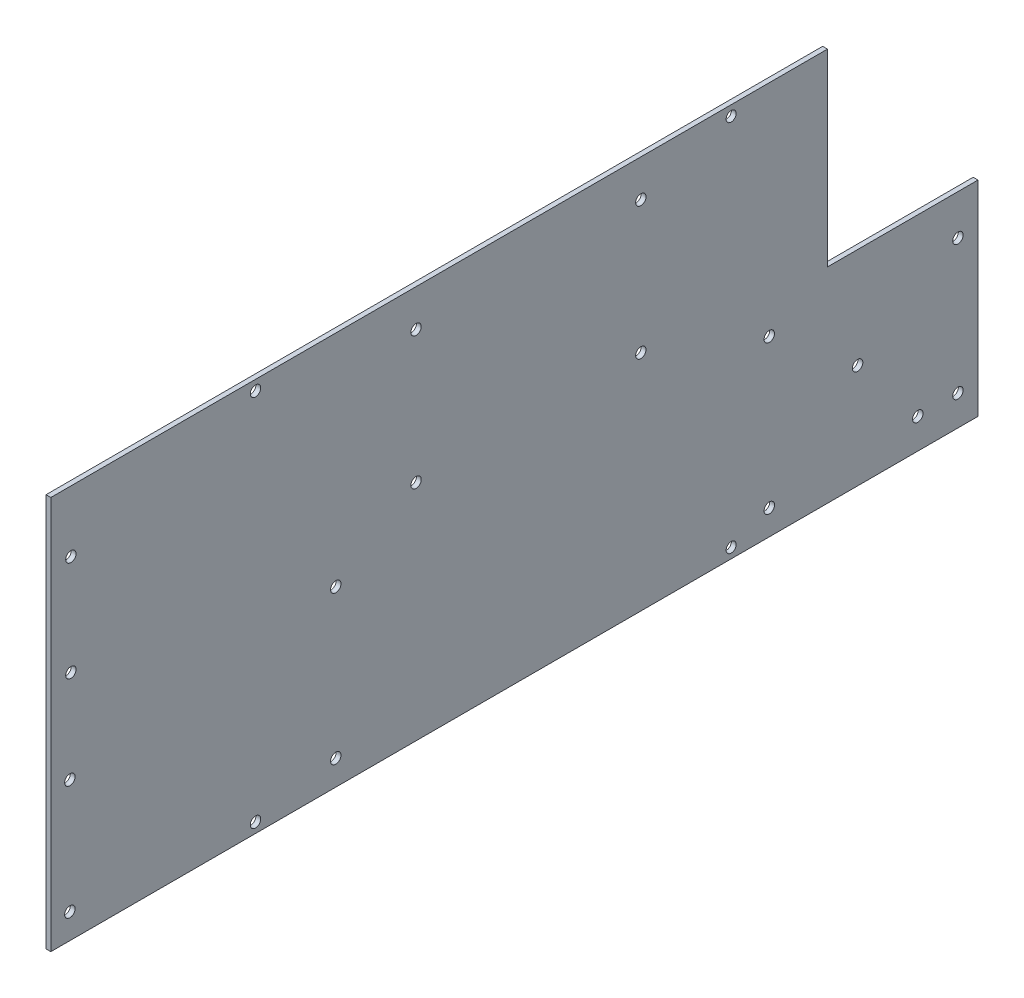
ISO-10303-21;
HEADER;
FILE_DESCRIPTION(('STEP AP214'),'2;1');
FILE_NAME('part.step','',(''),(''),'','','');
FILE_SCHEMA(('AUTOMOTIVE_DESIGN { 1 0 10303 214 1 1 1 1 }'));
ENDSEC;
DATA;
#1=APPLICATION_CONTEXT('core data for automotive mechanical design processes');
#2=APPLICATION_PROTOCOL_DEFINITION('international standard','automotive_design',2000,#1);
#3=PRODUCT_CONTEXT('',#1,'mechanical');
#4=PRODUCT('Part','Part','',(#3));
#5=PRODUCT_RELATED_PRODUCT_CATEGORY('part','',(#4));
#6=PRODUCT_DEFINITION_FORMATION('','',#4);
#7=PRODUCT_DEFINITION_CONTEXT('part definition',#1,'design');
#8=PRODUCT_DEFINITION('design','',#6,#7);
#9=PRODUCT_DEFINITION_SHAPE('','',#8);
#10=(LENGTH_UNIT() NAMED_UNIT(*) SI_UNIT(.MILLI.,.METRE.));
#11=(NAMED_UNIT(*) PLANE_ANGLE_UNIT() SI_UNIT($,.RADIAN.));
#12=(NAMED_UNIT(*) SI_UNIT($,.STERADIAN.) SOLID_ANGLE_UNIT());
#13=UNCERTAINTY_MEASURE_WITH_UNIT(LENGTH_MEASURE(1.E-05),#10,'distance_accuracy_value','');
#14=(GEOMETRIC_REPRESENTATION_CONTEXT(3) GLOBAL_UNCERTAINTY_ASSIGNED_CONTEXT((#13)) GLOBAL_UNIT_ASSIGNED_CONTEXT((#10,
#11,#12)) REPRESENTATION_CONTEXT('',''));
#15=CARTESIAN_POINT('',(0.,0.,0.));
#16=DIRECTION('',(0.,0.,1.));
#17=DIRECTION('',(1.,0.,0.));
#18=AXIS2_PLACEMENT_3D('',#15,#16,#17);
#19=CARTESIAN_POINT('',(1.52400000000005,64.7700000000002,-228.599999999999));
#20=DIRECTION('',(-1.00000000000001,0.,0.));
#21=DIRECTION('',(0.,0.,1.));
#22=AXIS2_PLACEMENT_3D('',#19,#20,#21);
#23=PLANE('',#22);
#24=CARTESIAN_POINT('',(1.524,9.55547999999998,-209.55));
#25=DIRECTION('',(1.00000000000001,0.,0.));
#26=DIRECTION('',(0.,0.,-1.));
#27=AXIS2_PLACEMENT_3D('',#24,#25,#26);
#28=CIRCLE('',#27,1.65100000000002);
#29=CARTESIAN_POINT('',(1.524,9.55547999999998,-211.201));
#30=VERTEX_POINT('',#29);
#31=EDGE_CURVE('E244',#30,#30,#28,.T.);
#32=ORIENTED_EDGE('',*,*,#31,.F.);
#33=EDGE_LOOP('',(#32));
#34=FACE_BOUND('',#33,.T.);
#35=CARTESIAN_POINT('',(1.52400000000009,9.55548000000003,-222.25));
#36=DIRECTION('',(1.00000000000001,0.,0.));
#37=DIRECTION('',(0.,0.,-1.));
#38=AXIS2_PLACEMENT_3D('',#35,#36,#37);
#39=CIRCLE('',#38,1.65099999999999);
#40=CARTESIAN_POINT('',(1.52400000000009,9.55548000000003,-223.901));
#41=VERTEX_POINT('',#40);
#42=EDGE_CURVE('E246',#41,#41,#39,.T.);
#43=ORIENTED_EDGE('',*,*,#42,.F.);
#44=EDGE_LOOP('',(#43));
#45=FACE_BOUND('',#44,.T.);
#46=CARTESIAN_POINT('',(1.52399999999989,121.285000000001,-150.495));
#47=DIRECTION('',(1.00000000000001,0.,0.));
#48=DIRECTION('',(0.,0.,-1.));
#49=AXIS2_PLACEMENT_3D('',#46,#47,#48);
#50=CIRCLE('',#49,1.58749999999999);
#51=CARTESIAN_POINT('',(1.52399999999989,121.285000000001,-152.0825));
#52=VERTEX_POINT('',#51);
#53=EDGE_CURVE('E261',#52,#52,#50,.T.);
#54=ORIENTED_EDGE('',*,*,#53,.F.);
#55=EDGE_LOOP('',(#54));
#56=FACE_BOUND('',#55,.T.);
#57=CARTESIAN_POINT('',(1.52400000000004,33.0200000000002,-190.5));
#58=DIRECTION('',(1.00000000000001,0.,0.));
#59=DIRECTION('',(0.,0.,-1.));
#60=AXIS2_PLACEMENT_3D('',#57,#58,#59);
#61=CIRCLE('',#60,1.65100000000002);
#62=CARTESIAN_POINT('',(1.52400000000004,33.0200000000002,-192.151));
#63=VERTEX_POINT('',#62);
#64=EDGE_CURVE('E273',#63,#63,#61,.T.);
#65=ORIENTED_EDGE('',*,*,#64,.F.);
#66=EDGE_LOOP('',(#65));
#67=FACE_BOUND('',#66,.T.);
#68=CARTESIAN_POINT('',(1.52400000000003,121.285000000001,0.));
#69=DIRECTION('',(1.00000000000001,0.,0.));
#70=DIRECTION('',(0.,0.,-1.));
#71=AXIS2_PLACEMENT_3D('',#68,#69,#70);
#72=CIRCLE('',#71,1.651);
#73=CARTESIAN_POINT('',(1.52400000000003,121.285000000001,-1.65099999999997));
#74=VERTEX_POINT('',#73);
#75=EDGE_CURVE('E285',#74,#74,#72,.T.);
#76=ORIENTED_EDGE('',*,*,#75,.F.);
#77=EDGE_LOOP('',(#76));
#78=FACE_BOUND('',#77,.T.);
#79=CARTESIAN_POINT('',(1.52399999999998,7.93750000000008,58.7375000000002));
#80=DIRECTION('',(1.00000000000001,0.,0.));
#81=DIRECTION('',(0.,0.,-1.));
#82=AXIS2_PLACEMENT_3D('',#79,#80,#81);
#83=CIRCLE('',#82,1.65100000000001);
#84=CARTESIAN_POINT('',(1.52399999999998,7.93750000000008,57.0865000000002));
#85=VERTEX_POINT('',#84);
#86=EDGE_CURVE('E297',#85,#85,#83,.T.);
#87=ORIENTED_EDGE('',*,*,#86,.F.);
#88=EDGE_LOOP('',(#87));
#89=FACE_BOUND('',#88,.T.);
#90=CARTESIAN_POINT('',(1.52400000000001,7.93750000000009,-25.3999999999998));
#91=DIRECTION('',(1.00000000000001,0.,0.));
#92=DIRECTION('',(0.,0.,-1.));
#93=AXIS2_PLACEMENT_3D('',#90,#91,#92);
#94=CIRCLE('',#93,1.651);
#95=CARTESIAN_POINT('',(1.52400000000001,7.93750000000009,-27.0509999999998));
#96=VERTEX_POINT('',#95);
#97=EDGE_CURVE('E309',#96,#96,#94,.T.);
#98=ORIENTED_EDGE('',*,*,#97,.F.);
#99=EDGE_LOOP('',(#98));
#100=FACE_BOUND('',#99,.T.);
#101=CARTESIAN_POINT('',(1.52400000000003,54.9275000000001,-162.559999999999));
#102=DIRECTION('',(1.00000000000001,0.,0.));
#103=DIRECTION('',(0.,0.,-1.));
#104=AXIS2_PLACEMENT_3D('',#101,#102,#103);
#105=CIRCLE('',#104,1.65100000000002);
#106=CARTESIAN_POINT('',(1.52400000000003,54.9275000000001,-164.210999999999));
#107=VERTEX_POINT('',#106);
#108=EDGE_CURVE('E321',#107,#107,#105,.T.);
#109=ORIENTED_EDGE('',*,*,#108,.F.);
#110=EDGE_LOOP('',(#109));
#111=FACE_BOUND('',#110,.T.);
#112=CARTESIAN_POINT('',(1.52399999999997,73.3425000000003,58.42));
#113=DIRECTION('',(1.00000000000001,0.,0.));
#114=DIRECTION('',(0.,0.,-1.));
#115=AXIS2_PLACEMENT_3D('',#112,#113,#114);
#116=CIRCLE('',#115,1.63830000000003);
#117=CARTESIAN_POINT('',(1.52399999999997,73.3425000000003,56.7816999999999));
#118=VERTEX_POINT('',#117);
#119=EDGE_CURVE('E333',#118,#118,#116,.T.);
#120=ORIENTED_EDGE('',*,*,#119,.F.);
#121=EDGE_LOOP('',(#120));
#122=FACE_BOUND('',#121,.T.);
#123=CARTESIAN_POINT('',(1.524,112.7125,-121.92));
#124=DIRECTION('',(1.00000000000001,0.,0.));
#125=DIRECTION('',(0.,0.,-1.));
#126=AXIS2_PLACEMENT_3D('',#123,#124,#125);
#127=CIRCLE('',#126,1.63829999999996);
#128=CARTESIAN_POINT('',(1.524,112.7125,-123.5583));
#129=VERTEX_POINT('',#128);
#130=EDGE_CURVE('E345',#129,#129,#127,.T.);
#131=ORIENTED_EDGE('',*,*,#130,.F.);
#132=EDGE_LOOP('',(#131));
#133=FACE_BOUND('',#132,.T.);
#134=CARTESIAN_POINT('',(1.524,112.7125,-50.7999999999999));
#135=DIRECTION('',(1.00000000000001,0.,0.));
#136=DIRECTION('',(0.,0.,-1.));
#137=AXIS2_PLACEMENT_3D('',#134,#135,#136);
#138=CIRCLE('',#137,1.63830000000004);
#139=CARTESIAN_POINT('',(1.524,112.7125,-52.4382999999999));
#140=VERTEX_POINT('',#139);
#141=EDGE_CURVE('E119',#140,#140,#138,.T.);
#142=ORIENTED_EDGE('',*,*,#141,.F.);
#143=EDGE_LOOP('',(#142));
#144=FACE_BOUND('',#143,.T.);
#145=DIRECTION('',(0.,1.00000000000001,0.));
#146=VECTOR('',#145,1.);
#147=CARTESIAN_POINT('',(1.52400000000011,0.,-228.6));
#148=LINE('',#147,#146);
#149=CARTESIAN_POINT('',(1.52400000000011,0.,-228.6));
#150=VERTEX_POINT('',#149);
#151=CARTESIAN_POINT('',(1.52400000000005,64.7700000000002,-228.599999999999));
#152=VERTEX_POINT('',#151);
#153=EDGE_CURVE('E126',#150,#152,#148,.T.);
#154=ORIENTED_EDGE('',*,*,#153,.T.);
#155=DIRECTION('',(0.,0.,1.));
#156=VECTOR('',#155,1.);
#157=CARTESIAN_POINT('',(1.52400000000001,64.7700000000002,-180.974999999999));
#158=LINE('',#157,#156);
#159=CARTESIAN_POINT('',(1.52400000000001,64.7700000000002,-180.974999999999));
#160=VERTEX_POINT('',#159);
#161=EDGE_CURVE('E84',#152,#160,#158,.T.);
#162=ORIENTED_EDGE('',*,*,#161,.T.);
#163=DIRECTION('',(0.,1.00000000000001,0.));
#164=VECTOR('',#163,1.);
#165=CARTESIAN_POINT('',(1.52400000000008,124.46,-180.975));
#166=LINE('',#165,#164);
#167=CARTESIAN_POINT('',(1.52400000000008,124.46,-180.975));
#168=VERTEX_POINT('',#167);
#169=EDGE_CURVE('E97',#160,#168,#166,.T.);
#170=ORIENTED_EDGE('',*,*,#169,.T.);
#171=DIRECTION('',(0.,0.,1.));
#172=VECTOR('',#171,1.);
#173=CARTESIAN_POINT('',(1.52400000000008,124.46,-180.975));
#174=LINE('',#173,#172);
#175=CARTESIAN_POINT('',(1.52400000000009,124.460000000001,64.77));
#176=VERTEX_POINT('',#175);
#177=EDGE_CURVE('E91',#168,#176,#174,.T.);
#178=ORIENTED_EDGE('',*,*,#177,.T.);
#179=DIRECTION('',(0.,-1.00000000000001,0.));
#180=VECTOR('',#179,1.);
#181=CARTESIAN_POINT('',(1.52400000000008,0.,64.7700000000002));
#182=LINE('',#181,#180);
#183=CARTESIAN_POINT('',(1.52400000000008,0.,64.7700000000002));
#184=VERTEX_POINT('',#183);
#185=EDGE_CURVE('E95',#176,#184,#182,.T.);
#186=ORIENTED_EDGE('',*,*,#185,.T.);
#187=DIRECTION('',(0.,0.,-1.));
#188=VECTOR('',#187,1.);
#189=CARTESIAN_POINT('',(1.52400000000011,0.,-228.6));
#190=LINE('',#189,#188);
#191=EDGE_CURVE('E47',#184,#150,#190,.T.);
#192=ORIENTED_EDGE('',*,*,#191,.T.);
#193=EDGE_LOOP('',(#154,#162,#170,#178,#186,#192));
#194=FACE_BOUND('',#193,.T.);
#195=CARTESIAN_POINT('',(1.524,70.8025000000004,-50.8));
#196=DIRECTION('',(1.00000000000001,0.,0.));
#197=DIRECTION('',(0.,0.,-1.));
#198=AXIS2_PLACEMENT_3D('',#195,#196,#197);
#199=CIRCLE('',#198,1.63830000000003);
#200=CARTESIAN_POINT('',(1.524,70.8025000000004,-52.4383));
#201=VERTEX_POINT('',#200);
#202=EDGE_CURVE('E351',#201,#201,#199,.T.);
#203=ORIENTED_EDGE('',*,*,#202,.F.);
#204=EDGE_LOOP('',(#203));
#205=FACE_BOUND('',#204,.T.);
#206=CARTESIAN_POINT('',(1.52399999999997,70.8025000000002,-121.92));
#207=DIRECTION('',(1.00000000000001,0.,0.));
#208=DIRECTION('',(0.,0.,-1.));
#209=AXIS2_PLACEMENT_3D('',#206,#207,#208);
#210=CIRCLE('',#209,1.63829999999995);
#211=CARTESIAN_POINT('',(1.52399999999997,70.8025000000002,-123.5583));
#212=VERTEX_POINT('',#211);
#213=EDGE_CURVE('E339',#212,#212,#210,.T.);
#214=ORIENTED_EDGE('',*,*,#213,.F.);
#215=EDGE_LOOP('',(#214));
#216=FACE_BOUND('',#215,.T.);
#217=CARTESIAN_POINT('',(1.52400000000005,105.092500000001,58.42));
#218=DIRECTION('',(1.00000000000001,0.,0.));
#219=DIRECTION('',(0.,0.,-1.));
#220=AXIS2_PLACEMENT_3D('',#217,#218,#219);
#221=CIRCLE('',#220,1.6383);
#222=CARTESIAN_POINT('',(1.52400000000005,105.092500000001,56.7817));
#223=VERTEX_POINT('',#222);
#224=EDGE_CURVE('E327',#223,#223,#221,.T.);
#225=ORIENTED_EDGE('',*,*,#224,.F.);
#226=EDGE_LOOP('',(#225));
#227=FACE_BOUND('',#226,.T.);
#228=CARTESIAN_POINT('',(1.52400000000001,54.9275,-25.4));
#229=DIRECTION('',(1.00000000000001,0.,0.));
#230=DIRECTION('',(0.,0.,-1.));
#231=AXIS2_PLACEMENT_3D('',#228,#229,#230);
#232=CIRCLE('',#231,1.651);
#233=CARTESIAN_POINT('',(1.52400000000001,54.9275,-27.051));
#234=VERTEX_POINT('',#233);
#235=EDGE_CURVE('E315',#234,#234,#232,.T.);
#236=ORIENTED_EDGE('',*,*,#235,.F.);
#237=EDGE_LOOP('',(#236));
#238=FACE_BOUND('',#237,.T.);
#239=CARTESIAN_POINT('',(1.52399999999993,7.93750000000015,-162.56));
#240=DIRECTION('',(1.00000000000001,0.,0.));
#241=DIRECTION('',(0.,0.,-1.));
#242=AXIS2_PLACEMENT_3D('',#239,#240,#241);
#243=CIRCLE('',#242,1.65100000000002);
#244=CARTESIAN_POINT('',(1.52399999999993,7.93750000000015,-164.211));
#245=VERTEX_POINT('',#244);
#246=EDGE_CURVE('E303',#245,#245,#243,.T.);
#247=ORIENTED_EDGE('',*,*,#246,.F.);
#248=EDGE_LOOP('',(#247));
#249=FACE_BOUND('',#248,.T.);
#250=CARTESIAN_POINT('',(1.52400000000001,44.1147200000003,58.7375000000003));
#251=DIRECTION('',(1.00000000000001,0.,0.));
#252=DIRECTION('',(0.,0.,-1.));
#253=AXIS2_PLACEMENT_3D('',#250,#251,#252);
#254=CIRCLE('',#253,1.65100000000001);
#255=CARTESIAN_POINT('',(1.52400000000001,44.1147200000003,57.0865000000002));
#256=VERTEX_POINT('',#255);
#257=EDGE_CURVE('E291',#256,#256,#254,.T.);
#258=ORIENTED_EDGE('',*,*,#257,.F.);
#259=EDGE_LOOP('',(#258));
#260=FACE_BOUND('',#259,.T.);
#261=CARTESIAN_POINT('',(1.52399999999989,3.17499999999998,0.));
#262=DIRECTION('',(1.00000000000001,0.,0.));
#263=DIRECTION('',(0.,0.,-1.));
#264=AXIS2_PLACEMENT_3D('',#261,#262,#263);
#265=CIRCLE('',#264,1.651);
#266=CARTESIAN_POINT('',(1.52399999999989,3.17499999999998,-1.65099999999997));
#267=VERTEX_POINT('',#266);
#268=EDGE_CURVE('E279',#267,#267,#265,.T.);
#269=ORIENTED_EDGE('',*,*,#268,.F.);
#270=EDGE_LOOP('',(#269));
#271=FACE_BOUND('',#270,.T.);
#272=CARTESIAN_POINT('',(1.52400000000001,52.0700000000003,-222.249999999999));
#273=DIRECTION('',(1.00000000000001,0.,0.));
#274=DIRECTION('',(0.,0.,-1.));
#275=AXIS2_PLACEMENT_3D('',#272,#273,#274);
#276=CIRCLE('',#275,1.65100000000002);
#277=CARTESIAN_POINT('',(1.52400000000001,52.0700000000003,-223.900999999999));
#278=VERTEX_POINT('',#277);
#279=EDGE_CURVE('E267',#278,#278,#276,.T.);
#280=ORIENTED_EDGE('',*,*,#279,.F.);
#281=EDGE_LOOP('',(#280));
#282=FACE_BOUND('',#281,.T.);
#283=CARTESIAN_POINT('',(1.52399999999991,3.17499999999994,-150.495));
#284=DIRECTION('',(1.00000000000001,0.,0.));
#285=DIRECTION('',(0.,0.,-1.));
#286=AXIS2_PLACEMENT_3D('',#283,#284,#285);
#287=CIRCLE('',#286,1.58749999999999);
#288=CARTESIAN_POINT('',(1.52399999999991,3.17499999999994,-152.0825));
#289=VERTEX_POINT('',#288);
#290=EDGE_CURVE('E255',#289,#289,#287,.T.);
#291=ORIENTED_EDGE('',*,*,#290,.F.);
#292=EDGE_LOOP('',(#291));
#293=FACE_BOUND('',#292,.T.);
#294=ADVANCED_FACE('F30',(#34,#45,#56,#67,#78,#89,#100,#111,#122,#133,#144,#194,#205,#216,#227,
#238,#249,#260,#271,#282,#293),#23,.F.);
#295=CARTESIAN_POINT('',(0.,64.7700000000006,-228.599999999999));
#296=DIRECTION('',(-1.00000000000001,0.,0.));
#297=DIRECTION('',(0.,0.,1.));
#298=AXIS2_PLACEMENT_3D('',#295,#296,#297);
#299=PLANE('',#298);
#300=CARTESIAN_POINT('',(0.,9.55548000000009,-209.55));
#301=DIRECTION('',(1.00000000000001,0.,0.));
#302=DIRECTION('',(0.,0.,-1.));
#303=AXIS2_PLACEMENT_3D('',#300,#301,#302);
#304=CIRCLE('',#303,1.65100000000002);
#305=CARTESIAN_POINT('',(0.,9.55548000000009,-211.201));
#306=VERTEX_POINT('',#305);
#307=EDGE_CURVE('E242',#306,#306,#304,.T.);
#308=ORIENTED_EDGE('',*,*,#307,.T.);
#309=EDGE_LOOP('',(#308));
#310=FACE_BOUND('',#309,.T.);
#311=CARTESIAN_POINT('',(-1.2490009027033E-13,9.55548000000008,-222.25));
#312=DIRECTION('',(1.00000000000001,0.,0.));
#313=DIRECTION('',(0.,0.,-1.));
#314=AXIS2_PLACEMENT_3D('',#311,#312,#313);
#315=CIRCLE('',#314,1.65099999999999);
#316=CARTESIAN_POINT('',(-1.2490009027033E-13,9.55548000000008,-223.901));
#317=VERTEX_POINT('',#316);
#318=EDGE_CURVE('E249',#317,#317,#315,.T.);
#319=ORIENTED_EDGE('',*,*,#318,.T.);
#320=EDGE_LOOP('',(#319));
#321=FACE_BOUND('',#320,.T.);
#322=CARTESIAN_POINT('',(0.,121.285000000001,-150.495));
#323=DIRECTION('',(1.00000000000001,0.,0.));
#324=DIRECTION('',(0.,0.,-1.));
#325=AXIS2_PLACEMENT_3D('',#322,#323,#324);
#326=CIRCLE('',#325,1.58749999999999);
#327=CARTESIAN_POINT('',(0.,121.285000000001,-152.0825));
#328=VERTEX_POINT('',#327);
#329=EDGE_CURVE('E258',#328,#328,#326,.T.);
#330=ORIENTED_EDGE('',*,*,#329,.T.);
#331=EDGE_LOOP('',(#330));
#332=FACE_BOUND('',#331,.T.);
#333=CARTESIAN_POINT('',(0.,33.02,-190.499999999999));
#334=DIRECTION('',(1.00000000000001,0.,0.));
#335=DIRECTION('',(0.,0.,-1.));
#336=AXIS2_PLACEMENT_3D('',#333,#334,#335);
#337=CIRCLE('',#336,1.65100000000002);
#338=CARTESIAN_POINT('',(0.,33.02,-192.150999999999));
#339=VERTEX_POINT('',#338);
#340=EDGE_CURVE('E270',#339,#339,#337,.T.);
#341=ORIENTED_EDGE('',*,*,#340,.T.);
#342=EDGE_LOOP('',(#341));
#343=FACE_BOUND('',#342,.T.);
#344=CARTESIAN_POINT('',(0.,121.285000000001,0.));
#345=DIRECTION('',(1.00000000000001,0.,0.));
#346=DIRECTION('',(0.,0.,-1.));
#347=AXIS2_PLACEMENT_3D('',#344,#345,#346);
#348=CIRCLE('',#347,1.651);
#349=CARTESIAN_POINT('',(0.,121.285000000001,-1.65099999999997));
#350=VERTEX_POINT('',#349);
#351=EDGE_CURVE('E282',#350,#350,#348,.T.);
#352=ORIENTED_EDGE('',*,*,#351,.T.);
#353=EDGE_LOOP('',(#352));
#354=FACE_BOUND('',#353,.T.);
#355=CARTESIAN_POINT('',(0.,7.93750000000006,58.7375000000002));
#356=DIRECTION('',(1.00000000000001,0.,0.));
#357=DIRECTION('',(0.,0.,-1.));
#358=AXIS2_PLACEMENT_3D('',#355,#356,#357);
#359=CIRCLE('',#358,1.65100000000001);
#360=CARTESIAN_POINT('',(0.,7.93750000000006,57.0865000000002));
#361=VERTEX_POINT('',#360);
#362=EDGE_CURVE('E294',#361,#361,#359,.T.);
#363=ORIENTED_EDGE('',*,*,#362,.T.);
#364=EDGE_LOOP('',(#363));
#365=FACE_BOUND('',#364,.T.);
#366=CARTESIAN_POINT('',(0.,7.93750000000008,-25.3999999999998));
#367=DIRECTION('',(1.00000000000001,0.,0.));
#368=DIRECTION('',(0.,0.,-1.));
#369=AXIS2_PLACEMENT_3D('',#366,#367,#368);
#370=CIRCLE('',#369,1.651);
#371=CARTESIAN_POINT('',(0.,7.93750000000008,-27.0509999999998));
#372=VERTEX_POINT('',#371);
#373=EDGE_CURVE('E306',#372,#372,#370,.T.);
#374=ORIENTED_EDGE('',*,*,#373,.T.);
#375=EDGE_LOOP('',(#374));
#376=FACE_BOUND('',#375,.T.);
#377=CARTESIAN_POINT('',(1.38777878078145E-13,54.9275000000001,-162.559999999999));
#378=DIRECTION('',(1.00000000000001,0.,0.));
#379=DIRECTION('',(0.,0.,-1.));
#380=AXIS2_PLACEMENT_3D('',#377,#378,#379);
#381=CIRCLE('',#380,1.65100000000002);
#382=CARTESIAN_POINT('',(1.38777878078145E-13,54.9275000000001,-164.210999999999));
#383=VERTEX_POINT('',#382);
#384=EDGE_CURVE('E318',#383,#383,#381,.T.);
#385=ORIENTED_EDGE('',*,*,#384,.T.);
#386=EDGE_LOOP('',(#385));
#387=FACE_BOUND('',#386,.T.);
#388=CARTESIAN_POINT('',(0.,73.3425000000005,58.42));
#389=DIRECTION('',(1.00000000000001,0.,0.));
#390=DIRECTION('',(0.,0.,-1.));
#391=AXIS2_PLACEMENT_3D('',#388,#389,#390);
#392=CIRCLE('',#391,1.63830000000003);
#393=CARTESIAN_POINT('',(0.,73.3425000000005,56.7816999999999));
#394=VERTEX_POINT('',#393);
#395=EDGE_CURVE('E330',#394,#394,#392,.T.);
#396=ORIENTED_EDGE('',*,*,#395,.T.);
#397=EDGE_LOOP('',(#396));
#398=FACE_BOUND('',#397,.T.);
#399=CARTESIAN_POINT('',(1.38777878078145E-13,112.712500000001,-121.92));
#400=DIRECTION('',(1.00000000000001,0.,0.));
#401=DIRECTION('',(0.,0.,-1.));
#402=AXIS2_PLACEMENT_3D('',#399,#400,#401);
#403=CIRCLE('',#402,1.63829999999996);
#404=CARTESIAN_POINT('',(1.38777878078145E-13,112.712500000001,-123.5583));
#405=VERTEX_POINT('',#404);
#406=EDGE_CURVE('E342',#405,#405,#403,.T.);
#407=ORIENTED_EDGE('',*,*,#406,.T.);
#408=EDGE_LOOP('',(#407));
#409=FACE_BOUND('',#408,.T.);
#410=CARTESIAN_POINT('',(0.,112.7125,-50.7999999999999));
#411=DIRECTION('',(1.00000000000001,0.,0.));
#412=DIRECTION('',(0.,0.,-1.));
#413=AXIS2_PLACEMENT_3D('',#410,#411,#412);
#414=CIRCLE('',#413,1.63830000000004);
#415=CARTESIAN_POINT('',(0.,112.7125,-52.4383));
#416=VERTEX_POINT('',#415);
#417=EDGE_CURVE('E354',#416,#416,#414,.T.);
#418=ORIENTED_EDGE('',*,*,#417,.T.);
#419=EDGE_LOOP('',(#418));
#420=FACE_BOUND('',#419,.T.);
#421=DIRECTION('',(0.,1.00000000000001,0.));
#422=VECTOR('',#421,1.);
#423=CARTESIAN_POINT('',(0.,0.,-228.6));
#424=LINE('',#423,#422);
#425=CARTESIAN_POINT('',(0.,0.,-228.6));
#426=VERTEX_POINT('',#425);
#427=CARTESIAN_POINT('',(0.,64.7700000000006,-228.599999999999));
#428=VERTEX_POINT('',#427);
#429=EDGE_CURVE('E115',#426,#428,#424,.T.);
#430=ORIENTED_EDGE('',*,*,#429,.F.);
#431=DIRECTION('',(0.,0.,-1.));
#432=VECTOR('',#431,1.);
#433=CARTESIAN_POINT('',(0.,0.,-228.6));
#434=LINE('',#433,#432);
#435=CARTESIAN_POINT('',(0.,0.,64.7700000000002));
#436=VERTEX_POINT('',#435);
#437=EDGE_CURVE('E76',#436,#426,#434,.T.);
#438=ORIENTED_EDGE('',*,*,#437,.F.);
#439=DIRECTION('',(0.,-1.00000000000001,0.));
#440=VECTOR('',#439,1.);
#441=CARTESIAN_POINT('',(0.,0.,64.7700000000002));
#442=LINE('',#441,#440);
#443=CARTESIAN_POINT('',(0.,124.460000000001,64.77));
#444=VERTEX_POINT('',#443);
#445=EDGE_CURVE('E70',#444,#436,#442,.T.);
#446=ORIENTED_EDGE('',*,*,#445,.F.);
#447=DIRECTION('',(0.,0.,1.));
#448=VECTOR('',#447,1.);
#449=CARTESIAN_POINT('',(0.,124.46,-180.975));
#450=LINE('',#449,#448);
#451=CARTESIAN_POINT('',(0.,124.46,-180.975));
#452=VERTEX_POINT('',#451);
#453=EDGE_CURVE('E105',#452,#444,#450,.T.);
#454=ORIENTED_EDGE('',*,*,#453,.F.);
#455=DIRECTION('',(0.,1.00000000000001,0.));
#456=VECTOR('',#455,1.);
#457=CARTESIAN_POINT('',(0.,124.46,-180.975));
#458=LINE('',#457,#456);
#459=CARTESIAN_POINT('',(0.,64.7700000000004,-180.974999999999));
#460=VERTEX_POINT('',#459);
#461=EDGE_CURVE('E121',#460,#452,#458,.T.);
#462=ORIENTED_EDGE('',*,*,#461,.F.);
#463=DIRECTION('',(0.,0.,1.));
#464=VECTOR('',#463,1.);
#465=CARTESIAN_POINT('',(0.,64.7700000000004,-180.974999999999));
#466=LINE('',#465,#464);
#467=EDGE_CURVE('E118',#428,#460,#466,.T.);
#468=ORIENTED_EDGE('',*,*,#467,.F.);
#469=EDGE_LOOP('',(#430,#438,#446,#454,#462,#468));
#470=FACE_BOUND('',#469,.T.);
#471=CARTESIAN_POINT('',(0.,70.8025000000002,-50.8));
#472=DIRECTION('',(1.00000000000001,0.,0.));
#473=DIRECTION('',(0.,0.,-1.));
#474=AXIS2_PLACEMENT_3D('',#471,#472,#473);
#475=CIRCLE('',#474,1.63830000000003);
#476=CARTESIAN_POINT('',(0.,70.8025000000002,-52.4383));
#477=VERTEX_POINT('',#476);
#478=EDGE_CURVE('E348',#477,#477,#475,.T.);
#479=ORIENTED_EDGE('',*,*,#478,.T.);
#480=EDGE_LOOP('',(#479));
#481=FACE_BOUND('',#480,.T.);
#482=CARTESIAN_POINT('',(0.,70.8025000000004,-121.92));
#483=DIRECTION('',(1.00000000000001,0.,0.));
#484=DIRECTION('',(0.,0.,-1.));
#485=AXIS2_PLACEMENT_3D('',#482,#483,#484);
#486=CIRCLE('',#485,1.63829999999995);
#487=CARTESIAN_POINT('',(0.,70.8025000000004,-123.5583));
#488=VERTEX_POINT('',#487);
#489=EDGE_CURVE('E336',#488,#488,#486,.T.);
#490=ORIENTED_EDGE('',*,*,#489,.T.);
#491=EDGE_LOOP('',(#490));
#492=FACE_BOUND('',#491,.T.);
#493=CARTESIAN_POINT('',(0.,105.092500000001,58.42));
#494=DIRECTION('',(1.00000000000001,0.,0.));
#495=DIRECTION('',(0.,0.,-1.));
#496=AXIS2_PLACEMENT_3D('',#493,#494,#495);
#497=CIRCLE('',#496,1.6383);
#498=CARTESIAN_POINT('',(0.,105.092500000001,56.7817));
#499=VERTEX_POINT('',#498);
#500=EDGE_CURVE('E324',#499,#499,#497,.T.);
#501=ORIENTED_EDGE('',*,*,#500,.T.);
#502=EDGE_LOOP('',(#501));
#503=FACE_BOUND('',#502,.T.);
#504=CARTESIAN_POINT('',(1.11022302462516E-13,54.9275000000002,-25.4));
#505=DIRECTION('',(1.00000000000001,0.,0.));
#506=DIRECTION('',(0.,0.,-1.));
#507=AXIS2_PLACEMENT_3D('',#504,#505,#506);
#508=CIRCLE('',#507,1.651);
#509=CARTESIAN_POINT('',(1.11022302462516E-13,54.9275000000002,-27.051));
#510=VERTEX_POINT('',#509);
#511=EDGE_CURVE('E312',#510,#510,#508,.T.);
#512=ORIENTED_EDGE('',*,*,#511,.T.);
#513=EDGE_LOOP('',(#512));
#514=FACE_BOUND('',#513,.T.);
#515=CARTESIAN_POINT('',(0.,7.93750000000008,-162.56));
#516=DIRECTION('',(1.00000000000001,0.,0.));
#517=DIRECTION('',(0.,0.,-1.));
#518=AXIS2_PLACEMENT_3D('',#515,#516,#517);
#519=CIRCLE('',#518,1.65100000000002);
#520=CARTESIAN_POINT('',(0.,7.93750000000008,-164.211));
#521=VERTEX_POINT('',#520);
#522=EDGE_CURVE('E300',#521,#521,#519,.T.);
#523=ORIENTED_EDGE('',*,*,#522,.T.);
#524=EDGE_LOOP('',(#523));
#525=FACE_BOUND('',#524,.T.);
#526=CARTESIAN_POINT('',(0.,44.1147200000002,58.7375000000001));
#527=DIRECTION('',(1.00000000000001,0.,0.));
#528=DIRECTION('',(0.,0.,-1.));
#529=AXIS2_PLACEMENT_3D('',#526,#527,#528);
#530=CIRCLE('',#529,1.65100000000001);
#531=CARTESIAN_POINT('',(0.,44.1147200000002,57.0865000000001));
#532=VERTEX_POINT('',#531);
#533=EDGE_CURVE('E288',#532,#532,#530,.T.);
#534=ORIENTED_EDGE('',*,*,#533,.T.);
#535=EDGE_LOOP('',(#534));
#536=FACE_BOUND('',#535,.T.);
#537=CARTESIAN_POINT('',(1.11022302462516E-13,3.17499999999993,0.));
#538=DIRECTION('',(1.00000000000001,0.,0.));
#539=DIRECTION('',(0.,0.,-1.));
#540=AXIS2_PLACEMENT_3D('',#537,#538,#539);
#541=CIRCLE('',#540,1.651);
#542=CARTESIAN_POINT('',(1.11022302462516E-13,3.17499999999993,-1.65099999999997));
#543=VERTEX_POINT('',#542);
#544=EDGE_CURVE('E276',#543,#543,#541,.T.);
#545=ORIENTED_EDGE('',*,*,#544,.T.);
#546=EDGE_LOOP('',(#545));
#547=FACE_BOUND('',#546,.T.);
#548=CARTESIAN_POINT('',(0.,52.0700000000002,-222.249999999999));
#549=DIRECTION('',(1.00000000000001,0.,0.));
#550=DIRECTION('',(0.,0.,-1.));
#551=AXIS2_PLACEMENT_3D('',#548,#549,#550);
#552=CIRCLE('',#551,1.65100000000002);
#553=CARTESIAN_POINT('',(0.,52.0700000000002,-223.900999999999));
#554=VERTEX_POINT('',#553);
#555=EDGE_CURVE('E264',#554,#554,#552,.T.);
#556=ORIENTED_EDGE('',*,*,#555,.T.);
#557=EDGE_LOOP('',(#556));
#558=FACE_BOUND('',#557,.T.);
#559=CARTESIAN_POINT('',(0.,3.17499999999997,-150.495));
#560=DIRECTION('',(1.00000000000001,0.,0.));
#561=DIRECTION('',(0.,0.,-1.));
#562=AXIS2_PLACEMENT_3D('',#559,#560,#561);
#563=CIRCLE('',#562,1.58749999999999);
#564=CARTESIAN_POINT('',(0.,3.17499999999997,-152.0825));
#565=VERTEX_POINT('',#564);
#566=EDGE_CURVE('E252',#565,#565,#563,.T.);
#567=ORIENTED_EDGE('',*,*,#566,.T.);
#568=EDGE_LOOP('',(#567));
#569=FACE_BOUND('',#568,.T.);
#570=ADVANCED_FACE('F135',(#310,#321,#332,#343,#354,#365,#376,#387,#398,#409,#420,#470,#481,
#492,#503,#514,#525,#536,#547,#558,#569),#299,.T.);
#571=CARTESIAN_POINT('',(1.52400000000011,0.,-228.6));
#572=DIRECTION('',(0.,0.,1.));
#573=DIRECTION('',(1.00000000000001,0.,0.));
#574=AXIS2_PLACEMENT_3D('',#571,#572,#573);
#575=PLANE('',#574);
#576=ORIENTED_EDGE('',*,*,#429,.T.);
#577=DIRECTION('',(-1.00000000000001,0.,0.));
#578=VECTOR('',#577,1.);
#579=CARTESIAN_POINT('',(1.52400000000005,64.7700000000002,-228.599999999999));
#580=LINE('',#579,#578);
#581=EDGE_CURVE('E11',#152,#428,#580,.T.);
#582=ORIENTED_EDGE('',*,*,#581,.F.);
#583=ORIENTED_EDGE('',*,*,#153,.F.);
#584=DIRECTION('',(-1.00000000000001,0.,0.));
#585=VECTOR('',#584,1.);
#586=CARTESIAN_POINT('',(1.52400000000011,0.,-228.6));
#587=LINE('',#586,#585);
#588=EDGE_CURVE('E111',#150,#426,#587,.T.);
#589=ORIENTED_EDGE('',*,*,#588,.T.);
#590=EDGE_LOOP('',(#576,#582,#583,#589));
#591=FACE_BOUND('',#590,.T.);
#592=ADVANCED_FACE('F32',(#591),#575,.F.);
#593=CARTESIAN_POINT('',(1.52400000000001,64.7700000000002,-180.974999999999));
#594=DIRECTION('',(0.,-1.00000000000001,0.));
#595=DIRECTION('',(0.,0.,-1.));
#596=AXIS2_PLACEMENT_3D('',#593,#594,#595);
#597=PLANE('',#596);
#598=ORIENTED_EDGE('',*,*,#467,.T.);
#599=DIRECTION('',(-1.00000000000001,0.,0.));
#600=VECTOR('',#599,1.);
#601=CARTESIAN_POINT('',(1.52400000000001,64.7700000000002,-180.974999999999));
#602=LINE('',#601,#600);
#603=EDGE_CURVE('E39',#160,#460,#602,.T.);
#604=ORIENTED_EDGE('',*,*,#603,.F.);
#605=ORIENTED_EDGE('',*,*,#161,.F.);
#606=ORIENTED_EDGE('',*,*,#581,.T.);
#607=EDGE_LOOP('',(#598,#604,#605,#606));
#608=FACE_BOUND('',#607,.T.);
#609=ADVANCED_FACE('F549',(#608),#597,.F.);
#610=CARTESIAN_POINT('',(1.52400000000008,124.46,-180.975));
#611=DIRECTION('',(0.,0.,1.));
#612=DIRECTION('',(1.00000000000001,0.,0.));
#613=AXIS2_PLACEMENT_3D('',#610,#611,#612);
#614=PLANE('',#613);
#615=ORIENTED_EDGE('',*,*,#461,.T.);
#616=DIRECTION('',(-1.00000000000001,0.,0.));
#617=VECTOR('',#616,1.);
#618=CARTESIAN_POINT('',(1.52400000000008,124.46,-180.975));
#619=LINE('',#618,#617);
#620=EDGE_CURVE('E106',#168,#452,#619,.T.);
#621=ORIENTED_EDGE('',*,*,#620,.F.);
#622=ORIENTED_EDGE('',*,*,#169,.F.);
#623=ORIENTED_EDGE('',*,*,#603,.T.);
#624=EDGE_LOOP('',(#615,#621,#622,#623));
#625=FACE_BOUND('',#624,.T.);
#626=ADVANCED_FACE('F132',(#625),#614,.F.);
#627=CARTESIAN_POINT('',(1.52400000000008,124.46,-180.975));
#628=DIRECTION('',(0.,-1.00000000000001,0.));
#629=DIRECTION('',(0.,0.,-1.));
#630=AXIS2_PLACEMENT_3D('',#627,#628,#629);
#631=PLANE('',#630);
#632=ORIENTED_EDGE('',*,*,#453,.T.);
#633=DIRECTION('',(-1.00000000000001,0.,0.));
#634=VECTOR('',#633,1.);
#635=CARTESIAN_POINT('',(1.52400000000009,124.460000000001,64.77));
#636=LINE('',#635,#634);
#637=EDGE_CURVE('E102',#176,#444,#636,.T.);
#638=ORIENTED_EDGE('',*,*,#637,.F.);
#639=ORIENTED_EDGE('',*,*,#177,.F.);
#640=ORIENTED_EDGE('',*,*,#620,.T.);
#641=EDGE_LOOP('',(#632,#638,#639,#640));
#642=FACE_BOUND('',#641,.T.);
#643=ADVANCED_FACE('F103',(#642),#631,.F.);
#644=CARTESIAN_POINT('',(1.52400000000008,0.,64.7700000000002));
#645=DIRECTION('',(0.,0.,-1.));
#646=DIRECTION('',(-1.00000000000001,0.,0.));
#647=AXIS2_PLACEMENT_3D('',#644,#645,#646);
#648=PLANE('',#647);
#649=ORIENTED_EDGE('',*,*,#445,.T.);
#650=DIRECTION('',(-1.00000000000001,0.,0.));
#651=VECTOR('',#650,1.);
#652=CARTESIAN_POINT('',(1.52400000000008,0.,64.7700000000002));
#653=LINE('',#652,#651);
#654=EDGE_CURVE('E107',#184,#436,#653,.T.);
#655=ORIENTED_EDGE('',*,*,#654,.F.);
#656=ORIENTED_EDGE('',*,*,#185,.F.);
#657=ORIENTED_EDGE('',*,*,#637,.T.);
#658=EDGE_LOOP('',(#649,#655,#656,#657));
#659=FACE_BOUND('',#658,.T.);
#660=ADVANCED_FACE('F109',(#659),#648,.F.);
#661=CARTESIAN_POINT('',(1.52400000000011,0.,-228.6));
#662=DIRECTION('',(0.,1.00000000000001,0.));
#663=DIRECTION('',(0.,0.,1.));
#664=AXIS2_PLACEMENT_3D('',#661,#662,#663);
#665=PLANE('',#664);
#666=ORIENTED_EDGE('',*,*,#437,.T.);
#667=ORIENTED_EDGE('',*,*,#588,.F.);
#668=ORIENTED_EDGE('',*,*,#191,.F.);
#669=ORIENTED_EDGE('',*,*,#654,.T.);
#670=EDGE_LOOP('',(#666,#667,#668,#669));
#671=FACE_BOUND('',#670,.T.);
#672=ADVANCED_FACE('F140',(#671),#665,.F.);
#673=CARTESIAN_POINT('',(1.524,112.7125,-50.7999999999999));
#674=DIRECTION('',(-1.00000000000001,0.,0.));
#675=DIRECTION('',(0.,0.,1.));
#676=AXIS2_PLACEMENT_3D('',#673,#674,#675);
#677=CYLINDRICAL_SURFACE('',#676,1.63830000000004);
#678=ORIENTED_EDGE('',*,*,#141,.T.);
#679=EDGE_LOOP('',(#678));
#680=FACE_BOUND('',#679,.T.);
#681=ORIENTED_EDGE('',*,*,#417,.F.);
#682=EDGE_LOOP('',(#681));
#683=FACE_BOUND('',#682,.T.);
#684=ADVANCED_FACE('F142',(#680,#683),#677,.F.);
#685=CARTESIAN_POINT('',(1.524,70.8025000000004,-50.8));
#686=DIRECTION('',(-1.00000000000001,0.,0.));
#687=DIRECTION('',(0.,0.,1.));
#688=AXIS2_PLACEMENT_3D('',#685,#686,#687);
#689=CYLINDRICAL_SURFACE('',#688,1.63830000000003);
#690=ORIENTED_EDGE('',*,*,#202,.T.);
#691=EDGE_LOOP('',(#690));
#692=FACE_BOUND('',#691,.T.);
#693=ORIENTED_EDGE('',*,*,#478,.F.);
#694=EDGE_LOOP('',(#693));
#695=FACE_BOUND('',#694,.T.);
#696=ADVANCED_FACE('F148',(#692,#695),#689,.F.);
#697=CARTESIAN_POINT('',(1.524,112.7125,-121.92));
#698=DIRECTION('',(-1.00000000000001,0.,0.));
#699=DIRECTION('',(0.,0.,1.));
#700=AXIS2_PLACEMENT_3D('',#697,#698,#699);
#701=CYLINDRICAL_SURFACE('',#700,1.63829999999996);
#702=ORIENTED_EDGE('',*,*,#130,.T.);
#703=EDGE_LOOP('',(#702));
#704=FACE_BOUND('',#703,.T.);
#705=ORIENTED_EDGE('',*,*,#406,.F.);
#706=EDGE_LOOP('',(#705));
#707=FACE_BOUND('',#706,.T.);
#708=ADVANCED_FACE('F165',(#704,#707),#701,.F.);
#709=CARTESIAN_POINT('',(1.52399999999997,70.8025000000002,-121.92));
#710=DIRECTION('',(-1.00000000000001,0.,0.));
#711=DIRECTION('',(0.,0.,1.));
#712=AXIS2_PLACEMENT_3D('',#709,#710,#711);
#713=CYLINDRICAL_SURFACE('',#712,1.63829999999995);
#714=ORIENTED_EDGE('',*,*,#213,.T.);
#715=EDGE_LOOP('',(#714));
#716=FACE_BOUND('',#715,.T.);
#717=ORIENTED_EDGE('',*,*,#489,.F.);
#718=EDGE_LOOP('',(#717));
#719=FACE_BOUND('',#718,.T.);
#720=ADVANCED_FACE('F169',(#716,#719),#713,.F.);
#721=CARTESIAN_POINT('',(1.52399999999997,73.3425000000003,58.42));
#722=DIRECTION('',(-1.00000000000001,0.,0.));
#723=DIRECTION('',(0.,0.,1.));
#724=AXIS2_PLACEMENT_3D('',#721,#722,#723);
#725=CYLINDRICAL_SURFACE('',#724,1.63830000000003);
#726=ORIENTED_EDGE('',*,*,#119,.T.);
#727=EDGE_LOOP('',(#726));
#728=FACE_BOUND('',#727,.T.);
#729=ORIENTED_EDGE('',*,*,#395,.F.);
#730=EDGE_LOOP('',(#729));
#731=FACE_BOUND('',#730,.T.);
#732=ADVANCED_FACE('F173',(#728,#731),#725,.F.);
#733=CARTESIAN_POINT('',(1.52400000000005,105.092500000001,58.42));
#734=DIRECTION('',(-1.00000000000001,0.,0.));
#735=DIRECTION('',(0.,0.,1.));
#736=AXIS2_PLACEMENT_3D('',#733,#734,#735);
#737=CYLINDRICAL_SURFACE('',#736,1.6383);
#738=ORIENTED_EDGE('',*,*,#224,.T.);
#739=EDGE_LOOP('',(#738));
#740=FACE_BOUND('',#739,.T.);
#741=ORIENTED_EDGE('',*,*,#500,.F.);
#742=EDGE_LOOP('',(#741));
#743=FACE_BOUND('',#742,.T.);
#744=ADVANCED_FACE('F177',(#740,#743),#737,.F.);
#745=CARTESIAN_POINT('',(1.52400000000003,54.9275000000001,-162.559999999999));
#746=DIRECTION('',(-1.00000000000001,0.,0.));
#747=DIRECTION('',(0.,0.,1.));
#748=AXIS2_PLACEMENT_3D('',#745,#746,#747);
#749=CYLINDRICAL_SURFACE('',#748,1.65100000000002);
#750=ORIENTED_EDGE('',*,*,#108,.T.);
#751=EDGE_LOOP('',(#750));
#752=FACE_BOUND('',#751,.T.);
#753=ORIENTED_EDGE('',*,*,#384,.F.);
#754=EDGE_LOOP('',(#753));
#755=FACE_BOUND('',#754,.T.);
#756=ADVANCED_FACE('F181',(#752,#755),#749,.F.);
#757=CARTESIAN_POINT('',(1.52400000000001,54.9275,-25.4));
#758=DIRECTION('',(-1.00000000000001,0.,0.));
#759=DIRECTION('',(0.,0.,1.));
#760=AXIS2_PLACEMENT_3D('',#757,#758,#759);
#761=CYLINDRICAL_SURFACE('',#760,1.651);
#762=ORIENTED_EDGE('',*,*,#235,.T.);
#763=EDGE_LOOP('',(#762));
#764=FACE_BOUND('',#763,.T.);
#765=ORIENTED_EDGE('',*,*,#511,.F.);
#766=EDGE_LOOP('',(#765));
#767=FACE_BOUND('',#766,.T.);
#768=ADVANCED_FACE('F185',(#764,#767),#761,.F.);
#769=CARTESIAN_POINT('',(1.52400000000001,7.93750000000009,-25.3999999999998));
#770=DIRECTION('',(-1.00000000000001,0.,0.));
#771=DIRECTION('',(0.,0.,1.));
#772=AXIS2_PLACEMENT_3D('',#769,#770,#771);
#773=CYLINDRICAL_SURFACE('',#772,1.651);
#774=ORIENTED_EDGE('',*,*,#97,.T.);
#775=EDGE_LOOP('',(#774));
#776=FACE_BOUND('',#775,.T.);
#777=ORIENTED_EDGE('',*,*,#373,.F.);
#778=EDGE_LOOP('',(#777));
#779=FACE_BOUND('',#778,.T.);
#780=ADVANCED_FACE('F189',(#776,#779),#773,.F.);
#781=CARTESIAN_POINT('',(1.52399999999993,7.93750000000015,-162.56));
#782=DIRECTION('',(-1.00000000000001,0.,0.));
#783=DIRECTION('',(0.,0.,1.));
#784=AXIS2_PLACEMENT_3D('',#781,#782,#783);
#785=CYLINDRICAL_SURFACE('',#784,1.65100000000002);
#786=ORIENTED_EDGE('',*,*,#246,.T.);
#787=EDGE_LOOP('',(#786));
#788=FACE_BOUND('',#787,.T.);
#789=ORIENTED_EDGE('',*,*,#522,.F.);
#790=EDGE_LOOP('',(#789));
#791=FACE_BOUND('',#790,.T.);
#792=ADVANCED_FACE('F193',(#788,#791),#785,.F.);
#793=CARTESIAN_POINT('',(1.52399999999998,7.93750000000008,58.7375000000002));
#794=DIRECTION('',(-1.00000000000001,0.,0.));
#795=DIRECTION('',(0.,0.,1.));
#796=AXIS2_PLACEMENT_3D('',#793,#794,#795);
#797=CYLINDRICAL_SURFACE('',#796,1.65100000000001);
#798=ORIENTED_EDGE('',*,*,#86,.T.);
#799=EDGE_LOOP('',(#798));
#800=FACE_BOUND('',#799,.T.);
#801=ORIENTED_EDGE('',*,*,#362,.F.);
#802=EDGE_LOOP('',(#801));
#803=FACE_BOUND('',#802,.T.);
#804=ADVANCED_FACE('F197',(#800,#803),#797,.F.);
#805=CARTESIAN_POINT('',(1.52400000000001,44.1147200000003,58.7375000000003));
#806=DIRECTION('',(-1.00000000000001,0.,0.));
#807=DIRECTION('',(0.,0.,1.));
#808=AXIS2_PLACEMENT_3D('',#805,#806,#807);
#809=CYLINDRICAL_SURFACE('',#808,1.65100000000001);
#810=ORIENTED_EDGE('',*,*,#257,.T.);
#811=EDGE_LOOP('',(#810));
#812=FACE_BOUND('',#811,.T.);
#813=ORIENTED_EDGE('',*,*,#533,.F.);
#814=EDGE_LOOP('',(#813));
#815=FACE_BOUND('',#814,.T.);
#816=ADVANCED_FACE('F201',(#812,#815),#809,.F.);
#817=CARTESIAN_POINT('',(1.52400000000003,121.285000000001,0.));
#818=DIRECTION('',(-1.00000000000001,0.,0.));
#819=DIRECTION('',(0.,0.,1.));
#820=AXIS2_PLACEMENT_3D('',#817,#818,#819);
#821=CYLINDRICAL_SURFACE('',#820,1.651);
#822=ORIENTED_EDGE('',*,*,#75,.T.);
#823=EDGE_LOOP('',(#822));
#824=FACE_BOUND('',#823,.T.);
#825=ORIENTED_EDGE('',*,*,#351,.F.);
#826=EDGE_LOOP('',(#825));
#827=FACE_BOUND('',#826,.T.);
#828=ADVANCED_FACE('F205',(#824,#827),#821,.F.);
#829=CARTESIAN_POINT('',(1.52399999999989,3.17499999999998,0.));
#830=DIRECTION('',(-1.00000000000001,0.,0.));
#831=DIRECTION('',(0.,0.,1.));
#832=AXIS2_PLACEMENT_3D('',#829,#830,#831);
#833=CYLINDRICAL_SURFACE('',#832,1.651);
#834=ORIENTED_EDGE('',*,*,#268,.T.);
#835=EDGE_LOOP('',(#834));
#836=FACE_BOUND('',#835,.T.);
#837=ORIENTED_EDGE('',*,*,#544,.F.);
#838=EDGE_LOOP('',(#837));
#839=FACE_BOUND('',#838,.T.);
#840=ADVANCED_FACE('F209',(#836,#839),#833,.F.);
#841=CARTESIAN_POINT('',(1.52400000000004,33.0200000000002,-190.5));
#842=DIRECTION('',(-1.00000000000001,0.,0.));
#843=DIRECTION('',(0.,0.,1.));
#844=AXIS2_PLACEMENT_3D('',#841,#842,#843);
#845=CYLINDRICAL_SURFACE('',#844,1.65100000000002);
#846=ORIENTED_EDGE('',*,*,#64,.T.);
#847=EDGE_LOOP('',(#846));
#848=FACE_BOUND('',#847,.T.);
#849=ORIENTED_EDGE('',*,*,#340,.F.);
#850=EDGE_LOOP('',(#849));
#851=FACE_BOUND('',#850,.T.);
#852=ADVANCED_FACE('F213',(#848,#851),#845,.F.);
#853=CARTESIAN_POINT('',(1.52400000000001,52.0700000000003,-222.249999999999));
#854=DIRECTION('',(-1.00000000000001,0.,0.));
#855=DIRECTION('',(0.,0.,1.));
#856=AXIS2_PLACEMENT_3D('',#853,#854,#855);
#857=CYLINDRICAL_SURFACE('',#856,1.65100000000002);
#858=ORIENTED_EDGE('',*,*,#279,.T.);
#859=EDGE_LOOP('',(#858));
#860=FACE_BOUND('',#859,.T.);
#861=ORIENTED_EDGE('',*,*,#555,.F.);
#862=EDGE_LOOP('',(#861));
#863=FACE_BOUND('',#862,.T.);
#864=ADVANCED_FACE('F217',(#860,#863),#857,.F.);
#865=CARTESIAN_POINT('',(1.52399999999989,121.285000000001,-150.495));
#866=DIRECTION('',(-1.00000000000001,0.,0.));
#867=DIRECTION('',(0.,0.,1.));
#868=AXIS2_PLACEMENT_3D('',#865,#866,#867);
#869=CYLINDRICAL_SURFACE('',#868,1.58749999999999);
#870=ORIENTED_EDGE('',*,*,#53,.T.);
#871=EDGE_LOOP('',(#870));
#872=FACE_BOUND('',#871,.T.);
#873=ORIENTED_EDGE('',*,*,#329,.F.);
#874=EDGE_LOOP('',(#873));
#875=FACE_BOUND('',#874,.T.);
#876=ADVANCED_FACE('F221',(#872,#875),#869,.F.);
#877=CARTESIAN_POINT('',(1.52399999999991,3.17499999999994,-150.495));
#878=DIRECTION('',(-1.00000000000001,0.,0.));
#879=DIRECTION('',(0.,0.,1.));
#880=AXIS2_PLACEMENT_3D('',#877,#878,#879);
#881=CYLINDRICAL_SURFACE('',#880,1.58749999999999);
#882=ORIENTED_EDGE('',*,*,#290,.T.);
#883=EDGE_LOOP('',(#882));
#884=FACE_BOUND('',#883,.T.);
#885=ORIENTED_EDGE('',*,*,#566,.F.);
#886=EDGE_LOOP('',(#885));
#887=FACE_BOUND('',#886,.T.);
#888=ADVANCED_FACE('F225',(#884,#887),#881,.F.);
#889=CARTESIAN_POINT('',(-1.2490009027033E-13,9.55548000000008,-222.25));
#890=DIRECTION('',(1.00000000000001,0.,0.));
#891=DIRECTION('',(0.,0.,-1.));
#892=AXIS2_PLACEMENT_3D('',#889,#890,#891);
#893=CYLINDRICAL_SURFACE('',#892,1.65099999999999);
#894=ORIENTED_EDGE('',*,*,#318,.F.);
#895=EDGE_LOOP('',(#894));
#896=FACE_BOUND('',#895,.T.);
#897=ORIENTED_EDGE('',*,*,#42,.T.);
#898=EDGE_LOOP('',(#897));
#899=FACE_BOUND('',#898,.T.);
#900=ADVANCED_FACE('F229',(#896,#899),#893,.F.);
#901=CARTESIAN_POINT('',(0.,9.55548000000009,-209.55));
#902=DIRECTION('',(1.00000000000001,0.,0.));
#903=DIRECTION('',(0.,0.,-1.));
#904=AXIS2_PLACEMENT_3D('',#901,#902,#903);
#905=CYLINDRICAL_SURFACE('',#904,1.65100000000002);
#906=ORIENTED_EDGE('',*,*,#307,.F.);
#907=EDGE_LOOP('',(#906));
#908=FACE_BOUND('',#907,.T.);
#909=ORIENTED_EDGE('',*,*,#31,.T.);
#910=EDGE_LOOP('',(#909));
#911=FACE_BOUND('',#910,.T.);
#912=ADVANCED_FACE('F233',(#908,#911),#905,.F.);
#913=CLOSED_SHELL('',(#294,#570,#592,#609,#626,#643,#660,#672,#684,#696,#708,#720,#732,#744,
#756,#768,#780,#792,#804,#816,#828,#840,#852,#864,#876,#888,#900,#912));
#914=MANIFOLD_SOLID_BREP('B2',#913);
#915=ADVANCED_BREP_SHAPE_REPRESENTATION('',(#18,#914),#14);
#916=SHAPE_DEFINITION_REPRESENTATION(#9,#915);
ENDSEC;
END-ISO-10303-21;
